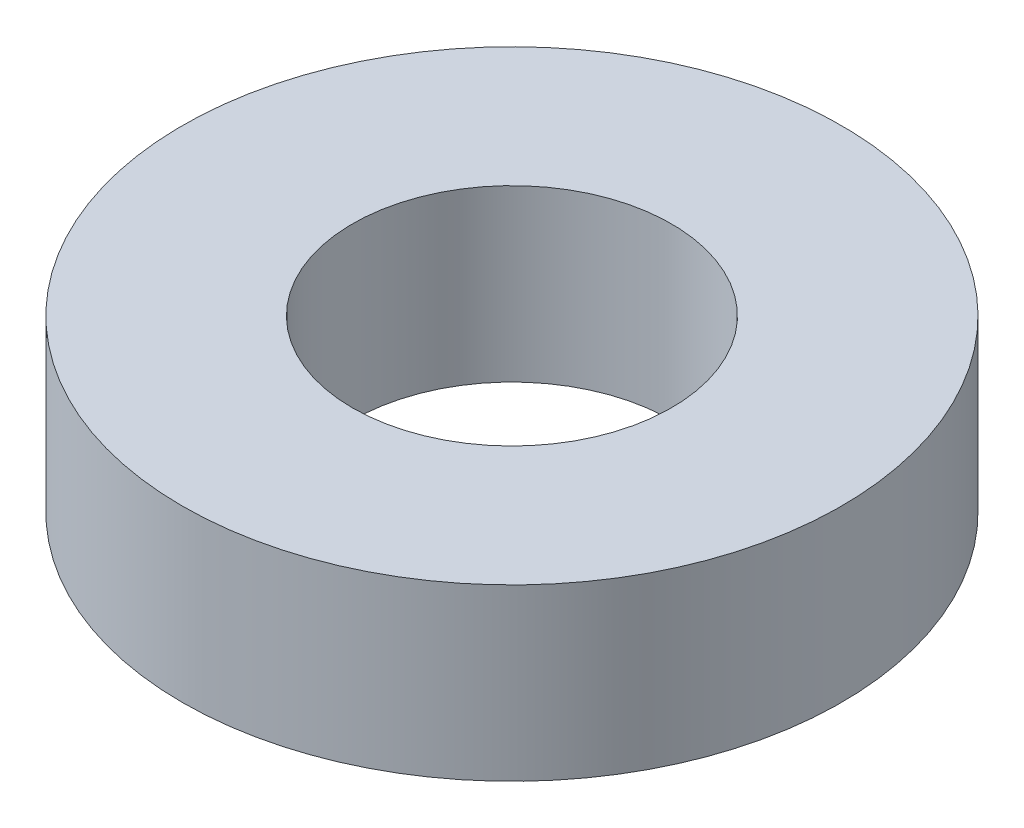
from build123d import *

# Parameters (mm, degrees)
SKETCH_1_R      = 31
SKETCH_1_R_2    = 15
EXTRUDE_1_DEPTH = 16


with BuildPart() as part:
    # Sketch 1 → Extrude 1 (new body)
    with BuildSketch(Plane(origin=(0, 0, 0), x_dir=(1, 0, 0), z_dir=(0, 1, 0))):
        with Locations(Location((0, 0, 0), (0, 0, 270))):
            Circle(SKETCH_1_R)
        with Locations(Location((0, 0, 0), (0, 0, 270))):
            Circle(SKETCH_1_R_2, mode=Mode.SUBTRACT)
    extrude(amount=EXTRUDE_1_DEPTH)


solid = part.part
